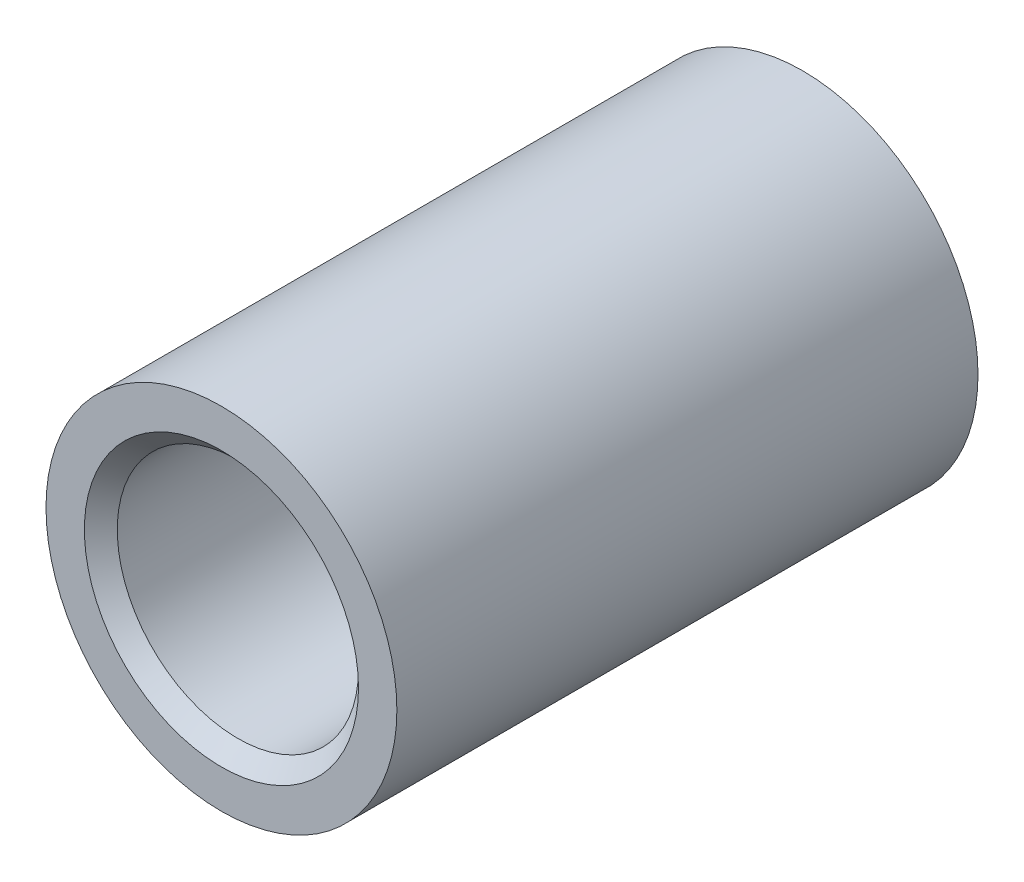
ISO-10303-21;
HEADER;
FILE_DESCRIPTION(('STEP AP214'),'2;1');
FILE_NAME('part.step','',(''),(''),'','','');
FILE_SCHEMA(('AUTOMOTIVE_DESIGN { 1 0 10303 214 1 1 1 1 }'));
ENDSEC;
DATA;
#1=APPLICATION_CONTEXT('core data for automotive mechanical design processes');
#2=APPLICATION_PROTOCOL_DEFINITION('international standard','automotive_design',2000,#1);
#3=PRODUCT_CONTEXT('',#1,'mechanical');
#4=PRODUCT('Part','Part','',(#3));
#5=PRODUCT_RELATED_PRODUCT_CATEGORY('part','',(#4));
#6=PRODUCT_DEFINITION_FORMATION('','',#4);
#7=PRODUCT_DEFINITION_CONTEXT('part definition',#1,'design');
#8=PRODUCT_DEFINITION('design','',#6,#7);
#9=PRODUCT_DEFINITION_SHAPE('','',#8);
#10=(LENGTH_UNIT() NAMED_UNIT(*) SI_UNIT(.MILLI.,.METRE.));
#11=(NAMED_UNIT(*) PLANE_ANGLE_UNIT() SI_UNIT($,.RADIAN.));
#12=(NAMED_UNIT(*) SI_UNIT($,.STERADIAN.) SOLID_ANGLE_UNIT());
#13=UNCERTAINTY_MEASURE_WITH_UNIT(LENGTH_MEASURE(1.E-05),#10,'distance_accuracy_value','');
#14=(GEOMETRIC_REPRESENTATION_CONTEXT(3) GLOBAL_UNCERTAINTY_ASSIGNED_CONTEXT((#13)) GLOBAL_UNIT_ASSIGNED_CONTEXT((#10,
#11,#12)) REPRESENTATION_CONTEXT('',''));
#15=CARTESIAN_POINT('',(0.,0.,0.));
#16=DIRECTION('',(0.,0.,1.));
#17=DIRECTION('',(1.,0.,0.));
#18=AXIS2_PLACEMENT_3D('',#15,#16,#17);
#19=CARTESIAN_POINT('',(0.,0.,53.));
#20=DIRECTION('',(0.,0.,1.));
#21=DIRECTION('',(1.,0.,0.));
#22=AXIS2_PLACEMENT_3D('',#19,#20,#21);
#23=PLANE('',#22);
#24=CARTESIAN_POINT('',(0.,0.,53.));
#25=DIRECTION('',(0.,0.,1.));
#26=DIRECTION('',(1.,0.,0.));
#27=AXIS2_PLACEMENT_3D('',#24,#25,#26);
#28=CIRCLE('',#27,12.5);
#29=CARTESIAN_POINT('',(12.5,0.,53.));
#30=VERTEX_POINT('',#29);
#31=EDGE_CURVE('E10',#30,#30,#28,.F.);
#32=ORIENTED_EDGE('',*,*,#31,.T.);
#33=EDGE_LOOP('',(#32));
#34=FACE_BOUND('',#33,.T.);
#35=CARTESIAN_POINT('',(0.,0.,53.));
#36=DIRECTION('',(0.,0.,1.));
#37=DIRECTION('',(1.,0.,0.));
#38=AXIS2_PLACEMENT_3D('',#35,#36,#37);
#39=CIRCLE('',#38,16.);
#40=CARTESIAN_POINT('',(16.,0.,53.));
#41=VERTEX_POINT('',#40);
#42=EDGE_CURVE('E64',#41,#41,#39,.T.);
#43=ORIENTED_EDGE('',*,*,#42,.T.);
#44=EDGE_LOOP('',(#43));
#45=FACE_BOUND('',#44,.T.);
#46=ADVANCED_FACE('F39',(#34,#45),#23,.T.);
#47=CARTESIAN_POINT('',(0.,0.,0.));
#48=DIRECTION('',(0.,0.,1.));
#49=DIRECTION('',(1.,0.,0.));
#50=AXIS2_PLACEMENT_3D('',#47,#48,#49);
#51=PLANE('',#50);
#52=CARTESIAN_POINT('',(0.,0.,0.));
#53=DIRECTION('',(0.,0.,1.));
#54=DIRECTION('',(1.,0.,0.));
#55=AXIS2_PLACEMENT_3D('',#52,#53,#54);
#56=CIRCLE('',#55,12.5);
#57=CARTESIAN_POINT('',(12.5,0.,0.));
#58=VERTEX_POINT('',#57);
#59=EDGE_CURVE('E58',#58,#58,#56,.T.);
#60=ORIENTED_EDGE('',*,*,#59,.T.);
#61=EDGE_LOOP('',(#60));
#62=FACE_BOUND('',#61,.T.);
#63=CARTESIAN_POINT('',(0.,0.,0.));
#64=DIRECTION('',(0.,0.,1.));
#65=DIRECTION('',(1.,0.,0.));
#66=AXIS2_PLACEMENT_3D('',#63,#64,#65);
#67=CIRCLE('',#66,16.);
#68=CARTESIAN_POINT('',(16.,0.,0.));
#69=VERTEX_POINT('',#68);
#70=EDGE_CURVE('E65',#69,#69,#67,.T.);
#71=ORIENTED_EDGE('',*,*,#70,.F.);
#72=EDGE_LOOP('',(#71));
#73=FACE_BOUND('',#72,.T.);
#74=ADVANCED_FACE('F78',(#62,#73),#51,.F.);
#75=CARTESIAN_POINT('',(0.,0.,53.));
#76=DIRECTION('',(0.,0.,-1.));
#77=DIRECTION('',(-1.,0.,0.));
#78=AXIS2_PLACEMENT_3D('',#75,#76,#77);
#79=CYLINDRICAL_SURFACE('',#78,16.);
#80=ORIENTED_EDGE('',*,*,#42,.F.);
#81=EDGE_LOOP('',(#80));
#82=FACE_BOUND('',#81,.T.);
#83=ORIENTED_EDGE('',*,*,#70,.T.);
#84=EDGE_LOOP('',(#83));
#85=FACE_BOUND('',#84,.T.);
#86=ADVANCED_FACE('F74',(#82,#85),#79,.T.);
#87=CARTESIAN_POINT('',(0.,0.,53.));
#88=DIRECTION('',(0.,0.,-1.));
#89=DIRECTION('',(-1.,0.,0.));
#90=AXIS2_PLACEMENT_3D('',#87,#88,#89);
#91=CYLINDRICAL_SURFACE('',#90,11.);
#92=CARTESIAN_POINT('',(0.,0.,1.5));
#93=DIRECTION('',(0.,0.,1.));
#94=DIRECTION('',(1.,0.,0.));
#95=AXIS2_PLACEMENT_3D('',#92,#93,#94);
#96=CIRCLE('',#95,11.);
#97=CARTESIAN_POINT('',(11.,0.,1.5));
#98=VERTEX_POINT('',#97);
#99=EDGE_CURVE('E48',#98,#98,#96,.F.);
#100=ORIENTED_EDGE('',*,*,#99,.T.);
#101=EDGE_LOOP('',(#100));
#102=FACE_BOUND('',#101,.T.);
#103=CARTESIAN_POINT('',(0.,0.,51.5));
#104=DIRECTION('',(0.,0.,1.));
#105=DIRECTION('',(1.,0.,0.));
#106=AXIS2_PLACEMENT_3D('',#103,#104,#105);
#107=CIRCLE('',#106,11.);
#108=CARTESIAN_POINT('',(11.,0.,51.5));
#109=VERTEX_POINT('',#108);
#110=EDGE_CURVE('E53',#109,#109,#107,.T.);
#111=ORIENTED_EDGE('',*,*,#110,.T.);
#112=EDGE_LOOP('',(#111));
#113=FACE_BOUND('',#112,.T.);
#114=ADVANCED_FACE('F77',(#102,#113),#91,.F.);
#115=CARTESIAN_POINT('',(0.,0.,0.));
#116=DIRECTION('',(0.,0.,-1.));
#117=DIRECTION('',(-1.,0.,0.));
#118=AXIS2_PLACEMENT_3D('',#115,#116,#117);
#119=CONICAL_SURFACE('',#118,12.5,0.785398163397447);
#120=ORIENTED_EDGE('',*,*,#99,.F.);
#121=EDGE_LOOP('',(#120));
#122=FACE_BOUND('',#121,.T.);
#123=ORIENTED_EDGE('',*,*,#59,.F.);
#124=EDGE_LOOP('',(#123));
#125=FACE_BOUND('',#124,.T.);
#126=ADVANCED_FACE('F91',(#122,#125),#119,.F.);
#127=CARTESIAN_POINT('',(0.,0.,51.5));
#128=DIRECTION('',(0.,0.,1.));
#129=DIRECTION('',(1.,0.,0.));
#130=AXIS2_PLACEMENT_3D('',#127,#128,#129);
#131=CONICAL_SURFACE('',#130,11.,0.78539816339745);
#132=CARTESIAN_POINT('',(12.5,0.,53.));
#133=CARTESIAN_POINT('',(12.484375,0.,52.984375));
#134=CARTESIAN_POINT('',(12.46875,0.,52.96875));
#135=CARTESIAN_POINT('',(12.4375,0.,52.9375));
#136=CARTESIAN_POINT('',(12.421875,0.,52.921875));
#137=CARTESIAN_POINT('',(12.390625,0.,52.890625));
#138=CARTESIAN_POINT('',(12.375,0.,52.875));
#139=CARTESIAN_POINT('',(12.34375,0.,52.84375));
#140=CARTESIAN_POINT('',(12.328125,0.,52.828125));
#141=CARTESIAN_POINT('',(12.296875,0.,52.796875));
#142=CARTESIAN_POINT('',(12.28125,0.,52.78125));
#143=CARTESIAN_POINT('',(12.25,0.,52.75));
#144=CARTESIAN_POINT('',(12.234375,0.,52.734375));
#145=CARTESIAN_POINT('',(12.203125,0.,52.703125));
#146=CARTESIAN_POINT('',(12.1875,0.,52.6875));
#147=CARTESIAN_POINT('',(12.15625,0.,52.65625));
#148=CARTESIAN_POINT('',(12.140625,0.,52.640625));
#149=CARTESIAN_POINT('',(12.109375,0.,52.609375));
#150=CARTESIAN_POINT('',(12.09375,0.,52.59375));
#151=CARTESIAN_POINT('',(12.0625,0.,52.5625));
#152=CARTESIAN_POINT('',(12.046875,0.,52.546875));
#153=CARTESIAN_POINT('',(12.015625,0.,52.515625));
#154=CARTESIAN_POINT('',(12.,0.,52.5));
#155=CARTESIAN_POINT('',(11.96875,0.,52.46875));
#156=CARTESIAN_POINT('',(11.953125,0.,52.453125));
#157=CARTESIAN_POINT('',(11.921875,0.,52.421875));
#158=CARTESIAN_POINT('',(11.90625,0.,52.40625));
#159=CARTESIAN_POINT('',(11.875,0.,52.375));
#160=CARTESIAN_POINT('',(11.859375,0.,52.359375));
#161=CARTESIAN_POINT('',(11.828125,0.,52.328125));
#162=CARTESIAN_POINT('',(11.8125,0.,52.3125));
#163=CARTESIAN_POINT('',(11.78125,0.,52.28125));
#164=CARTESIAN_POINT('',(11.765625,0.,52.265625));
#165=CARTESIAN_POINT('',(11.734375,0.,52.234375));
#166=CARTESIAN_POINT('',(11.71875,0.,52.21875));
#167=CARTESIAN_POINT('',(11.6875,0.,52.1875));
#168=CARTESIAN_POINT('',(11.671875,0.,52.171875));
#169=CARTESIAN_POINT('',(11.640625,0.,52.140625));
#170=CARTESIAN_POINT('',(11.625,0.,52.125));
#171=CARTESIAN_POINT('',(11.59375,0.,52.09375));
#172=CARTESIAN_POINT('',(11.578125,0.,52.078125));
#173=CARTESIAN_POINT('',(11.546875,0.,52.046875));
#174=CARTESIAN_POINT('',(11.53125,0.,52.03125));
#175=CARTESIAN_POINT('',(11.5,0.,52.));
#176=CARTESIAN_POINT('',(11.484375,0.,51.984375));
#177=CARTESIAN_POINT('',(11.453125,0.,51.953125));
#178=CARTESIAN_POINT('',(11.4375,0.,51.9375));
#179=CARTESIAN_POINT('',(11.40625,0.,51.90625));
#180=CARTESIAN_POINT('',(11.390625,0.,51.890625));
#181=CARTESIAN_POINT('',(11.359375,0.,51.859375));
#182=CARTESIAN_POINT('',(11.34375,0.,51.84375));
#183=CARTESIAN_POINT('',(11.3125,0.,51.8125));
#184=CARTESIAN_POINT('',(11.296875,0.,51.796875));
#185=CARTESIAN_POINT('',(11.265625,0.,51.765625));
#186=CARTESIAN_POINT('',(11.25,0.,51.75));
#187=CARTESIAN_POINT('',(11.21875,0.,51.71875));
#188=CARTESIAN_POINT('',(11.203125,0.,51.703125));
#189=CARTESIAN_POINT('',(11.171875,0.,51.671875));
#190=CARTESIAN_POINT('',(11.15625,0.,51.65625));
#191=CARTESIAN_POINT('',(11.125,0.,51.625));
#192=CARTESIAN_POINT('',(11.109375,0.,51.609375));
#193=CARTESIAN_POINT('',(11.078125,0.,51.578125));
#194=CARTESIAN_POINT('',(11.0625,0.,51.5625));
#195=CARTESIAN_POINT('',(11.03125,0.,51.53125));
#196=CARTESIAN_POINT('',(11.015625,0.,51.515625));
#197=CARTESIAN_POINT('',(11.,0.,51.5));
#198=B_SPLINE_CURVE_WITH_KNOTS('',3,(#132,#133,#134,#135,#136,#137,#138,#139,#140,#141,#142,
#143,#144,#145,#146,#147,#148,#149,#150,#151,#152,#153,#154,#155,#156,#157,#158,#159,#160,#161,
#162,#163,#164,#165,#166,#167,#168,#169,#170,#171,#172,#173,#174,#175,#176,#177,#178,#179,#180,
#181,#182,#183,#184,#185,#186,#187,#188,#189,#190,#191,#192,#193,#194,#195,#196,#197),
.UNSPECIFIED.,.F.,.F.,(4,2,2,2,2,2,2,2,2,2,2,2,2,2,2,2,2,2,2,2,2,2,2,2,2,2,2,2,2,2,2,2,4),(0.,
0.0662912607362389,0.132582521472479,0.198873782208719,0.265165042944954,0.331456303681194,
0.397747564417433,0.464038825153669,0.530330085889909,0.596621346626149,0.662912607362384,
0.729203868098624,0.795495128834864,0.861786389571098,0.928077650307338,0.994368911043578,
1.06066017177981,1.12695143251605,1.19324269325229,1.25953395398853,1.32582521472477,
1.39211647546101,1.45840773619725,1.52469899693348,1.59099025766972,1.65728151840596,
1.7235727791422,1.78986403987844,1.85615530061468,1.92244656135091,1.98873782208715,
2.05502908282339,2.12132034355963),.UNSPECIFIED.);
#199=EDGE_CURVE('BSEAM42',#30,#109,#198,.T.);
#200=ORIENTED_EDGE('',*,*,#31,.F.);
#201=ORIENTED_EDGE('',*,*,#110,.F.);
#202=ORIENTED_EDGE('',*,*,#199,.T.);
#203=ORIENTED_EDGE('',*,*,#199,.F.);
#204=EDGE_LOOP('',(#200,#202,#201,#203));
#205=FACE_BOUND('',#204,.T.);
#206=ADVANCED_FACE('F42',(#205),#131,.F.);
#207=CLOSED_SHELL('',(#46,#74,#86,#114,#126,#206));
#208=MANIFOLD_SOLID_BREP('B2',#207);
#209=ADVANCED_BREP_SHAPE_REPRESENTATION('',(#18,#208),#14);
#210=SHAPE_DEFINITION_REPRESENTATION(#9,#209);
ENDSEC;
END-ISO-10303-21;
